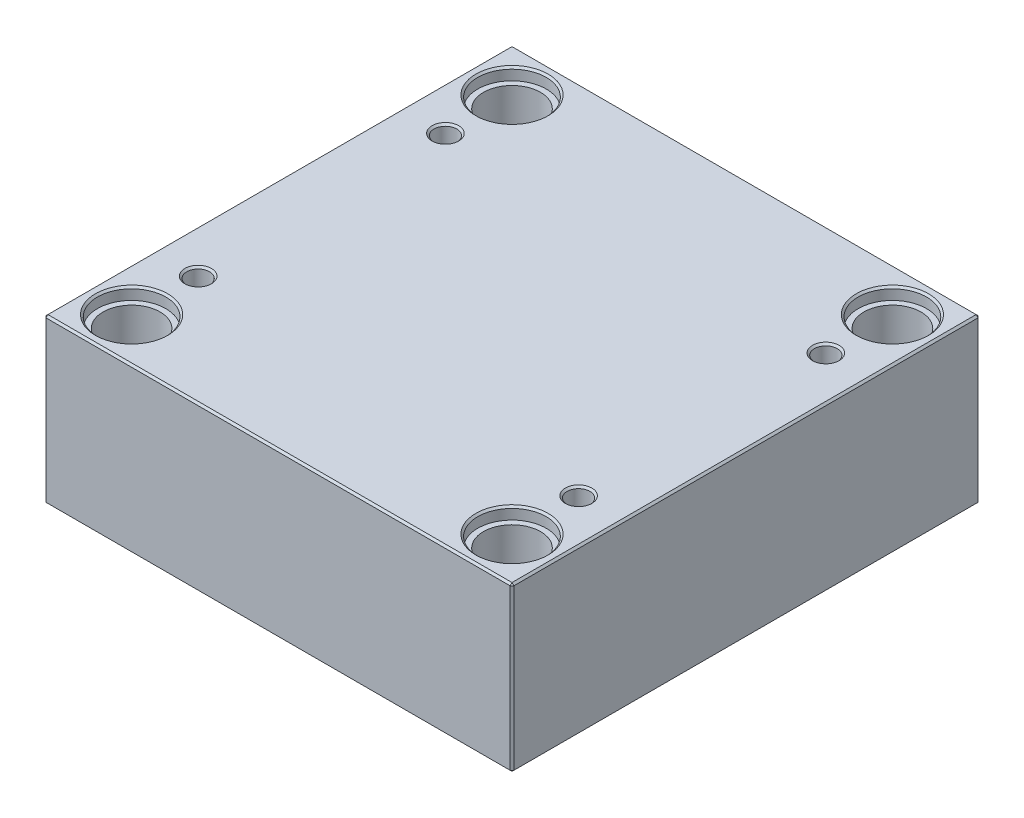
ISO-10303-21;
HEADER;
FILE_DESCRIPTION(('STEP AP214'),'2;1');
FILE_NAME('part.step','',(''),(''),'','','');
FILE_SCHEMA(('AUTOMOTIVE_DESIGN { 1 0 10303 214 1 1 1 1 }'));
ENDSEC;
DATA;
#1=APPLICATION_CONTEXT('core data for automotive mechanical design processes');
#2=APPLICATION_PROTOCOL_DEFINITION('international standard','automotive_design',2000,#1);
#3=PRODUCT_CONTEXT('',#1,'mechanical');
#4=PRODUCT('Part','Part','',(#3));
#5=PRODUCT_RELATED_PRODUCT_CATEGORY('part','',(#4));
#6=PRODUCT_DEFINITION_FORMATION('','',#4);
#7=PRODUCT_DEFINITION_CONTEXT('part definition',#1,'design');
#8=PRODUCT_DEFINITION('design','',#6,#7);
#9=PRODUCT_DEFINITION_SHAPE('','',#8);
#10=(LENGTH_UNIT() NAMED_UNIT(*) SI_UNIT(.MILLI.,.METRE.));
#11=(NAMED_UNIT(*) PLANE_ANGLE_UNIT() SI_UNIT($,.RADIAN.));
#12=(NAMED_UNIT(*) SI_UNIT($,.STERADIAN.) SOLID_ANGLE_UNIT());
#13=UNCERTAINTY_MEASURE_WITH_UNIT(LENGTH_MEASURE(1.E-05),#10,'distance_accuracy_value','');
#14=(GEOMETRIC_REPRESENTATION_CONTEXT(3) GLOBAL_UNCERTAINTY_ASSIGNED_CONTEXT((#13)) GLOBAL_UNIT_ASSIGNED_CONTEXT((#10,
#11,#12)) REPRESENTATION_CONTEXT('',''));
#15=CARTESIAN_POINT('',(0.,0.,0.));
#16=DIRECTION('',(0.,0.,1.));
#17=DIRECTION('',(1.,0.,0.));
#18=AXIS2_PLACEMENT_3D('',#15,#16,#17);
#19=CARTESIAN_POINT('',(-100.,0.,-100.));
#20=DIRECTION('',(0.,1.,0.));
#21=DIRECTION('',(0.,0.,1.));
#22=AXIS2_PLACEMENT_3D('',#19,#20,#21);
#23=CYLINDRICAL_SURFACE('',#22,15.);
#24=CARTESIAN_POINT('',(-100.,1.00000000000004,-100.));
#25=DIRECTION('',(0.,1.,0.));
#26=DIRECTION('',(0.,0.,1.));
#27=AXIS2_PLACEMENT_3D('',#24,#25,#26);
#28=CIRCLE('',#27,15.);
#29=CARTESIAN_POINT('',(-100.,1.00000000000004,-85.));
#30=VERTEX_POINT('',#29);
#31=EDGE_CURVE('E472',#30,#30,#28,.F.);
#32=ORIENTED_EDGE('',*,*,#31,.T.);
#33=EDGE_LOOP('',(#32));
#34=FACE_BOUND('',#33,.T.);
#35=CARTESIAN_POINT('',(-100.,79.7,-100.));
#36=DIRECTION('',(0.,1.,0.));
#37=DIRECTION('',(0.,0.,1.));
#38=AXIS2_PLACEMENT_3D('',#35,#36,#37);
#39=CIRCLE('',#38,15.);
#40=CARTESIAN_POINT('',(-100.,79.7,-85.));
#41=VERTEX_POINT('',#40);
#42=EDGE_CURVE('E221',#41,#41,#39,.F.);
#43=ORIENTED_EDGE('',*,*,#42,.F.);
#44=EDGE_LOOP('',(#43));
#45=FACE_BOUND('',#44,.T.);
#46=ADVANCED_FACE('F16',(#34,#45),#23,.F.);
#47=CARTESIAN_POINT('',(100.,0.,-100.));
#48=DIRECTION('',(0.,1.,0.));
#49=DIRECTION('',(0.,0.,1.));
#50=AXIS2_PLACEMENT_3D('',#47,#48,#49);
#51=CYLINDRICAL_SURFACE('',#50,15.);
#52=CARTESIAN_POINT('',(100.,1.00000000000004,-100.));
#53=DIRECTION('',(0.,1.,0.));
#54=DIRECTION('',(0.,0.,1.));
#55=AXIS2_PLACEMENT_3D('',#52,#53,#54);
#56=CIRCLE('',#55,15.);
#57=CARTESIAN_POINT('',(100.,1.00000000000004,-85.));
#58=VERTEX_POINT('',#57);
#59=EDGE_CURVE('E474',#58,#58,#56,.F.);
#60=ORIENTED_EDGE('',*,*,#59,.T.);
#61=EDGE_LOOP('',(#60));
#62=FACE_BOUND('',#61,.T.);
#63=CARTESIAN_POINT('',(100.,79.7,-100.));
#64=DIRECTION('',(0.,1.,0.));
#65=DIRECTION('',(0.,0.,1.));
#66=AXIS2_PLACEMENT_3D('',#63,#64,#65);
#67=CIRCLE('',#66,15.);
#68=CARTESIAN_POINT('',(100.,79.7,-85.));
#69=VERTEX_POINT('',#68);
#70=EDGE_CURVE('E218',#69,#69,#67,.F.);
#71=ORIENTED_EDGE('',*,*,#70,.F.);
#72=EDGE_LOOP('',(#71));
#73=FACE_BOUND('',#72,.T.);
#74=ADVANCED_FACE('F263',(#62,#73),#51,.F.);
#75=CARTESIAN_POINT('',(100.,0.,100.));
#76=DIRECTION('',(0.,1.,0.));
#77=DIRECTION('',(0.,0.,1.));
#78=AXIS2_PLACEMENT_3D('',#75,#76,#77);
#79=CYLINDRICAL_SURFACE('',#78,15.);
#80=CARTESIAN_POINT('',(100.,1.00000000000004,100.));
#81=DIRECTION('',(0.,1.,0.));
#82=DIRECTION('',(0.,0.,1.));
#83=AXIS2_PLACEMENT_3D('',#80,#81,#82);
#84=CIRCLE('',#83,15.);
#85=CARTESIAN_POINT('',(100.,1.00000000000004,115.));
#86=VERTEX_POINT('',#85);
#87=EDGE_CURVE('E477',#86,#86,#84,.F.);
#88=ORIENTED_EDGE('',*,*,#87,.T.);
#89=EDGE_LOOP('',(#88));
#90=FACE_BOUND('',#89,.T.);
#91=CARTESIAN_POINT('',(100.,79.7,100.));
#92=DIRECTION('',(0.,1.,0.));
#93=DIRECTION('',(0.,0.,1.));
#94=AXIS2_PLACEMENT_3D('',#91,#92,#93);
#95=CIRCLE('',#94,15.);
#96=CARTESIAN_POINT('',(100.,79.7,115.));
#97=VERTEX_POINT('',#96);
#98=EDGE_CURVE('E214',#97,#97,#95,.F.);
#99=ORIENTED_EDGE('',*,*,#98,.F.);
#100=EDGE_LOOP('',(#99));
#101=FACE_BOUND('',#100,.T.);
#102=ADVANCED_FACE('F270',(#90,#101),#79,.F.);
#103=CARTESIAN_POINT('',(-100.,0.,100.));
#104=DIRECTION('',(0.,1.,0.));
#105=DIRECTION('',(0.,0.,1.));
#106=AXIS2_PLACEMENT_3D('',#103,#104,#105);
#107=CYLINDRICAL_SURFACE('',#106,15.);
#108=CARTESIAN_POINT('',(-100.,1.00000000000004,100.));
#109=DIRECTION('',(0.,1.,0.));
#110=DIRECTION('',(0.,0.,1.));
#111=AXIS2_PLACEMENT_3D('',#108,#109,#110);
#112=CIRCLE('',#111,15.);
#113=CARTESIAN_POINT('',(-100.,1.00000000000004,115.));
#114=VERTEX_POINT('',#113);
#115=EDGE_CURVE('E480',#114,#114,#112,.F.);
#116=ORIENTED_EDGE('',*,*,#115,.T.);
#117=EDGE_LOOP('',(#116));
#118=FACE_BOUND('',#117,.T.);
#119=CARTESIAN_POINT('',(-100.,79.7,100.));
#120=DIRECTION('',(0.,1.,0.));
#121=DIRECTION('',(0.,0.,1.));
#122=AXIS2_PLACEMENT_3D('',#119,#120,#121);
#123=CIRCLE('',#122,15.);
#124=CARTESIAN_POINT('',(-100.,79.7,115.));
#125=VERTEX_POINT('',#124);
#126=EDGE_CURVE('E211',#125,#125,#123,.F.);
#127=ORIENTED_EDGE('',*,*,#126,.F.);
#128=EDGE_LOOP('',(#127));
#129=FACE_BOUND('',#128,.T.);
#130=ADVANCED_FACE('F277',(#118,#129),#107,.F.);
#131=CARTESIAN_POINT('',(-123.,86.,123.));
#132=DIRECTION('',(1.,0.,0.));
#133=DIRECTION('',(0.,0.,-1.));
#134=AXIS2_PLACEMENT_3D('',#131,#132,#133);
#135=PLANE('',#134);
#136=DIRECTION('',(0.,-1.,0.));
#137=VECTOR('',#136,1.);
#138=CARTESIAN_POINT('',(-123.,86.,-122.));
#139=LINE('',#138,#137);
#140=CARTESIAN_POINT('',(-123.,85.,-122.));
#141=VERTEX_POINT('',#140);
#142=CARTESIAN_POINT('',(-123.,1.,-122.));
#143=VERTEX_POINT('',#142);
#144=EDGE_CURVE('E487',#141,#143,#139,.T.);
#145=ORIENTED_EDGE('',*,*,#144,.T.);
#146=DIRECTION('',(0.,0.,1.));
#147=VECTOR('',#146,1.);
#148=CARTESIAN_POINT('',(-123.,1.,123.));
#149=LINE('',#148,#147);
#150=CARTESIAN_POINT('',(-123.,1.,122.));
#151=VERTEX_POINT('',#150);
#152=EDGE_CURVE('E490',#143,#151,#149,.T.);
#153=ORIENTED_EDGE('',*,*,#152,.T.);
#154=DIRECTION('',(0.,1.,0.));
#155=VECTOR('',#154,1.);
#156=CARTESIAN_POINT('',(-123.,86.,122.));
#157=LINE('',#156,#155);
#158=CARTESIAN_POINT('',(-123.,85.,122.));
#159=VERTEX_POINT('',#158);
#160=EDGE_CURVE('E485',#151,#159,#157,.T.);
#161=ORIENTED_EDGE('',*,*,#160,.T.);
#162=DIRECTION('',(0.,0.,-1.));
#163=VECTOR('',#162,1.);
#164=CARTESIAN_POINT('',(-123.,85.,-123.));
#165=LINE('',#164,#163);
#166=EDGE_CURVE('E483',#159,#141,#165,.T.);
#167=ORIENTED_EDGE('',*,*,#166,.T.);
#168=EDGE_LOOP('',(#145,#153,#161,#167));
#169=FACE_BOUND('',#168,.T.);
#170=ADVANCED_FACE('F298',(#169),#135,.F.);
#171=CARTESIAN_POINT('',(123.,86.,123.));
#172=DIRECTION('',(0.,0.,-1.));
#173=DIRECTION('',(-1.,0.,0.));
#174=AXIS2_PLACEMENT_3D('',#171,#172,#173);
#175=PLANE('',#174);
#176=DIRECTION('',(-1.,0.,0.));
#177=VECTOR('',#176,1.);
#178=CARTESIAN_POINT('',(-123.,85.,123.));
#179=LINE('',#178,#177);
#180=CARTESIAN_POINT('',(122.,85.,123.));
#181=VERTEX_POINT('',#180);
#182=CARTESIAN_POINT('',(-122.,85.,123.));
#183=VERTEX_POINT('',#182);
#184=EDGE_CURVE('E509',#181,#183,#179,.T.);
#185=ORIENTED_EDGE('',*,*,#184,.T.);
#186=DIRECTION('',(0.,-1.,0.));
#187=VECTOR('',#186,1.);
#188=CARTESIAN_POINT('',(-122.,86.,123.));
#189=LINE('',#188,#187);
#190=CARTESIAN_POINT('',(-122.,0.999999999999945,123.));
#191=VERTEX_POINT('',#190);
#192=EDGE_CURVE('E515',#183,#191,#189,.T.);
#193=ORIENTED_EDGE('',*,*,#192,.T.);
#194=DIRECTION('',(1.,0.,0.));
#195=VECTOR('',#194,1.);
#196=CARTESIAN_POINT('',(123.,0.999999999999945,123.));
#197=LINE('',#196,#195);
#198=CARTESIAN_POINT('',(122.,0.999999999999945,123.));
#199=VERTEX_POINT('',#198);
#200=EDGE_CURVE('E513',#191,#199,#197,.T.);
#201=ORIENTED_EDGE('',*,*,#200,.T.);
#202=DIRECTION('',(0.,1.,0.));
#203=VECTOR('',#202,1.);
#204=CARTESIAN_POINT('',(122.,86.,123.));
#205=LINE('',#204,#203);
#206=EDGE_CURVE('E511',#199,#181,#205,.T.);
#207=ORIENTED_EDGE('',*,*,#206,.T.);
#208=EDGE_LOOP('',(#185,#193,#201,#207));
#209=FACE_BOUND('',#208,.T.);
#210=ADVANCED_FACE('F294',(#209),#175,.F.);
#211=CARTESIAN_POINT('',(123.,86.,123.));
#212=DIRECTION('',(-1.,0.,0.));
#213=DIRECTION('',(0.,0.,1.));
#214=AXIS2_PLACEMENT_3D('',#211,#212,#213);
#215=PLANE('',#214);
#216=DIRECTION('',(0.,0.,-1.));
#217=VECTOR('',#216,1.);
#218=CARTESIAN_POINT('',(123.,0.999999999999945,123.));
#219=LINE('',#218,#217);
#220=CARTESIAN_POINT('',(123.,0.999999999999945,122.));
#221=VERTEX_POINT('',#220);
#222=CARTESIAN_POINT('',(123.,0.999999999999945,-122.));
#223=VERTEX_POINT('',#222);
#224=EDGE_CURVE('E504',#221,#223,#219,.T.);
#225=ORIENTED_EDGE('',*,*,#224,.T.);
#226=DIRECTION('',(0.,1.,0.));
#227=VECTOR('',#226,1.);
#228=CARTESIAN_POINT('',(123.,86.,-122.));
#229=LINE('',#228,#227);
#230=CARTESIAN_POINT('',(123.,85.,-122.));
#231=VERTEX_POINT('',#230);
#232=EDGE_CURVE('E506',#223,#231,#229,.T.);
#233=ORIENTED_EDGE('',*,*,#232,.T.);
#234=DIRECTION('',(0.,0.,1.));
#235=VECTOR('',#234,1.);
#236=CARTESIAN_POINT('',(123.,85.,123.));
#237=LINE('',#236,#235);
#238=CARTESIAN_POINT('',(123.,85.,122.));
#239=VERTEX_POINT('',#238);
#240=EDGE_CURVE('E500',#231,#239,#237,.T.);
#241=ORIENTED_EDGE('',*,*,#240,.T.);
#242=DIRECTION('',(0.,-1.,0.));
#243=VECTOR('',#242,1.);
#244=CARTESIAN_POINT('',(123.,86.,122.));
#245=LINE('',#244,#243);
#246=EDGE_CURVE('E502',#239,#221,#245,.T.);
#247=ORIENTED_EDGE('',*,*,#246,.T.);
#248=EDGE_LOOP('',(#225,#233,#241,#247));
#249=FACE_BOUND('',#248,.T.);
#250=ADVANCED_FACE('F290',(#249),#215,.F.);
#251=CARTESIAN_POINT('',(123.,86.,-123.));
#252=DIRECTION('',(0.,0.,1.));
#253=DIRECTION('',(1.,0.,0.));
#254=AXIS2_PLACEMENT_3D('',#251,#252,#253);
#255=PLANE('',#254);
#256=DIRECTION('',(0.,-1.,0.));
#257=VECTOR('',#256,1.);
#258=CARTESIAN_POINT('',(122.,86.,-123.));
#259=LINE('',#258,#257);
#260=CARTESIAN_POINT('',(122.,85.,-123.));
#261=VERTEX_POINT('',#260);
#262=CARTESIAN_POINT('',(122.,0.999999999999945,-123.));
#263=VERTEX_POINT('',#262);
#264=EDGE_CURVE('E494',#261,#263,#259,.T.);
#265=ORIENTED_EDGE('',*,*,#264,.T.);
#266=DIRECTION('',(-1.,0.,0.));
#267=VECTOR('',#266,1.);
#268=CARTESIAN_POINT('',(123.,0.999999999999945,-123.));
#269=LINE('',#268,#267);
#270=CARTESIAN_POINT('',(-122.,0.999999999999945,-123.));
#271=VERTEX_POINT('',#270);
#272=EDGE_CURVE('E138',#263,#271,#269,.T.);
#273=ORIENTED_EDGE('',*,*,#272,.T.);
#274=DIRECTION('',(0.,1.,0.));
#275=VECTOR('',#274,1.);
#276=CARTESIAN_POINT('',(-122.,86.,-123.));
#277=LINE('',#276,#275);
#278=CARTESIAN_POINT('',(-122.,85.,-123.));
#279=VERTEX_POINT('',#278);
#280=EDGE_CURVE('E496',#271,#279,#277,.T.);
#281=ORIENTED_EDGE('',*,*,#280,.T.);
#282=DIRECTION('',(1.,0.,0.));
#283=VECTOR('',#282,1.);
#284=CARTESIAN_POINT('',(123.,85.,-123.));
#285=LINE('',#284,#283);
#286=EDGE_CURVE('E492',#279,#261,#285,.T.);
#287=ORIENTED_EDGE('',*,*,#286,.T.);
#288=EDGE_LOOP('',(#265,#273,#281,#287));
#289=FACE_BOUND('',#288,.T.);
#290=ADVANCED_FACE('F282',(#289),#255,.F.);
#291=CARTESIAN_POINT('',(0.,86.,0.));
#292=DIRECTION('',(0.,1.,0.));
#293=DIRECTION('',(0.,0.,1.));
#294=AXIS2_PLACEMENT_3D('',#291,#292,#293);
#295=PLANE('',#294);
#296=CARTESIAN_POINT('',(100.,86.,100.));
#297=DIRECTION('',(0.,1.,0.));
#298=DIRECTION('',(0.,0.,1.));
#299=AXIS2_PLACEMENT_3D('',#296,#297,#298);
#300=CIRCLE('',#299,19.);
#301=CARTESIAN_POINT('',(100.,86.,119.));
#302=VERTEX_POINT('',#301);
#303=EDGE_CURVE('E236',#302,#302,#300,.F.);
#304=ORIENTED_EDGE('',*,*,#303,.T.);
#305=EDGE_LOOP('',(#304));
#306=FACE_BOUND('',#305,.T.);
#307=CARTESIAN_POINT('',(-100.,86.,100.));
#308=DIRECTION('',(0.,1.,0.));
#309=DIRECTION('',(0.,0.,1.));
#310=AXIS2_PLACEMENT_3D('',#307,#308,#309);
#311=CIRCLE('',#310,19.);
#312=CARTESIAN_POINT('',(-100.,86.,119.));
#313=VERTEX_POINT('',#312);
#314=EDGE_CURVE('E233',#313,#313,#311,.F.);
#315=ORIENTED_EDGE('',*,*,#314,.T.);
#316=EDGE_LOOP('',(#315));
#317=FACE_BOUND('',#316,.T.);
#318=CARTESIAN_POINT('',(100.,86.,-100.));
#319=DIRECTION('',(0.,1.,0.));
#320=DIRECTION('',(0.,0.,1.));
#321=AXIS2_PLACEMENT_3D('',#318,#319,#320);
#322=CIRCLE('',#321,19.);
#323=CARTESIAN_POINT('',(100.,86.,-81.));
#324=VERTEX_POINT('',#323);
#325=EDGE_CURVE('E230',#324,#324,#322,.F.);
#326=ORIENTED_EDGE('',*,*,#325,.T.);
#327=EDGE_LOOP('',(#326));
#328=FACE_BOUND('',#327,.T.);
#329=CARTESIAN_POINT('',(-100.,86.,-100.));
#330=DIRECTION('',(0.,1.,0.));
#331=DIRECTION('',(0.,0.,1.));
#332=AXIS2_PLACEMENT_3D('',#329,#330,#331);
#333=CIRCLE('',#332,19.);
#334=CARTESIAN_POINT('',(-100.,86.,-81.));
#335=VERTEX_POINT('',#334);
#336=EDGE_CURVE('E227',#335,#335,#333,.F.);
#337=ORIENTED_EDGE('',*,*,#336,.T.);
#338=EDGE_LOOP('',(#337));
#339=FACE_BOUND('',#338,.T.);
#340=CARTESIAN_POINT('',(-100.,86.,65.));
#341=DIRECTION('',(0.,1.,0.));
#342=DIRECTION('',(0.,0.,1.));
#343=AXIS2_PLACEMENT_3D('',#340,#341,#342);
#344=CIRCLE('',#343,7.);
#345=CARTESIAN_POINT('',(-100.,86.,72.));
#346=VERTEX_POINT('',#345);
#347=EDGE_CURVE('E198',#346,#346,#344,.F.);
#348=ORIENTED_EDGE('',*,*,#347,.T.);
#349=EDGE_LOOP('',(#348));
#350=FACE_BOUND('',#349,.T.);
#351=CARTESIAN_POINT('',(100.,86.,65.));
#352=DIRECTION('',(0.,1.,0.));
#353=DIRECTION('',(0.,0.,1.));
#354=AXIS2_PLACEMENT_3D('',#351,#352,#353);
#355=CIRCLE('',#354,7.);
#356=CARTESIAN_POINT('',(100.,86.,72.));
#357=VERTEX_POINT('',#356);
#358=EDGE_CURVE('E195',#357,#357,#355,.F.);
#359=ORIENTED_EDGE('',*,*,#358,.T.);
#360=EDGE_LOOP('',(#359));
#361=FACE_BOUND('',#360,.T.);
#362=CARTESIAN_POINT('',(100.,86.,-65.));
#363=DIRECTION('',(0.,1.,0.));
#364=DIRECTION('',(0.,0.,1.));
#365=AXIS2_PLACEMENT_3D('',#362,#363,#364);
#366=CIRCLE('',#365,7.);
#367=CARTESIAN_POINT('',(100.,86.,-58.));
#368=VERTEX_POINT('',#367);
#369=EDGE_CURVE('E192',#368,#368,#366,.F.);
#370=ORIENTED_EDGE('',*,*,#369,.T.);
#371=EDGE_LOOP('',(#370));
#372=FACE_BOUND('',#371,.T.);
#373=CARTESIAN_POINT('',(-100.,86.,-65.));
#374=DIRECTION('',(0.,1.,0.));
#375=DIRECTION('',(0.,0.,1.));
#376=AXIS2_PLACEMENT_3D('',#373,#374,#375);
#377=CIRCLE('',#376,7.);
#378=CARTESIAN_POINT('',(-100.,86.,-58.));
#379=VERTEX_POINT('',#378);
#380=EDGE_CURVE('E188',#379,#379,#377,.F.);
#381=ORIENTED_EDGE('',*,*,#380,.T.);
#382=EDGE_LOOP('',(#381));
#383=FACE_BOUND('',#382,.T.);
#384=DIRECTION('',(0.,0.,-1.));
#385=VECTOR('',#384,1.);
#386=CARTESIAN_POINT('',(122.,86.,-123.));
#387=LINE('',#386,#385);
#388=CARTESIAN_POINT('',(122.,86.,122.));
#389=VERTEX_POINT('',#388);
#390=CARTESIAN_POINT('',(122.,86.,-122.));
#391=VERTEX_POINT('',#390);
#392=EDGE_CURVE('E31',#389,#391,#387,.T.);
#393=ORIENTED_EDGE('',*,*,#392,.T.);
#394=DIRECTION('',(-1.,0.,0.));
#395=VECTOR('',#394,1.);
#396=CARTESIAN_POINT('',(-123.,86.,-122.));
#397=LINE('',#396,#395);
#398=CARTESIAN_POINT('',(-122.,86.,-122.));
#399=VERTEX_POINT('',#398);
#400=EDGE_CURVE('E189',#391,#399,#397,.T.);
#401=ORIENTED_EDGE('',*,*,#400,.T.);
#402=DIRECTION('',(0.,0.,1.));
#403=VECTOR('',#402,1.);
#404=CARTESIAN_POINT('',(-122.,86.,123.));
#405=LINE('',#404,#403);
#406=CARTESIAN_POINT('',(-122.,86.,122.));
#407=VERTEX_POINT('',#406);
#408=EDGE_CURVE('E518',#399,#407,#405,.T.);
#409=ORIENTED_EDGE('',*,*,#408,.T.);
#410=DIRECTION('',(1.,0.,0.));
#411=VECTOR('',#410,1.);
#412=CARTESIAN_POINT('',(123.,86.,122.));
#413=LINE('',#412,#411);
#414=EDGE_CURVE('E36',#407,#389,#413,.T.);
#415=ORIENTED_EDGE('',*,*,#414,.T.);
#416=EDGE_LOOP('',(#393,#401,#409,#415));
#417=FACE_BOUND('',#416,.T.);
#418=ADVANCED_FACE('F279',(#306,#317,#328,#339,#350,#361,#372,#383,#417),#295,.T.);
#419=CARTESIAN_POINT('',(0.,0.,0.));
#420=DIRECTION('',(0.,1.,0.));
#421=DIRECTION('',(0.,0.,1.));
#422=AXIS2_PLACEMENT_3D('',#419,#420,#421);
#423=PLANE('',#422);
#424=CARTESIAN_POINT('',(-100.,0.,-100.));
#425=DIRECTION('',(0.,1.,0.));
#426=DIRECTION('',(0.,0.,1.));
#427=AXIS2_PLACEMENT_3D('',#424,#425,#426);
#428=CIRCLE('',#427,16.);
#429=CARTESIAN_POINT('',(-100.,0.,-84.));
#430=VERTEX_POINT('',#429);
#431=EDGE_CURVE('E469',#430,#430,#428,.T.);
#432=ORIENTED_EDGE('',*,*,#431,.T.);
#433=EDGE_LOOP('',(#432));
#434=FACE_BOUND('',#433,.T.);
#435=CARTESIAN_POINT('',(100.,0.,-100.));
#436=DIRECTION('',(0.,1.,0.));
#437=DIRECTION('',(0.,0.,1.));
#438=AXIS2_PLACEMENT_3D('',#435,#436,#437);
#439=CIRCLE('',#438,16.);
#440=CARTESIAN_POINT('',(100.,0.,-84.));
#441=VERTEX_POINT('',#440);
#442=EDGE_CURVE('E466',#441,#441,#439,.T.);
#443=ORIENTED_EDGE('',*,*,#442,.T.);
#444=EDGE_LOOP('',(#443));
#445=FACE_BOUND('',#444,.T.);
#446=CARTESIAN_POINT('',(100.,0.,100.));
#447=DIRECTION('',(0.,1.,0.));
#448=DIRECTION('',(0.,0.,1.));
#449=AXIS2_PLACEMENT_3D('',#446,#447,#448);
#450=CIRCLE('',#449,16.);
#451=CARTESIAN_POINT('',(100.,0.,116.));
#452=VERTEX_POINT('',#451);
#453=EDGE_CURVE('E463',#452,#452,#450,.T.);
#454=ORIENTED_EDGE('',*,*,#453,.T.);
#455=EDGE_LOOP('',(#454));
#456=FACE_BOUND('',#455,.T.);
#457=CARTESIAN_POINT('',(-100.,0.,100.));
#458=DIRECTION('',(0.,1.,0.));
#459=DIRECTION('',(0.,0.,1.));
#460=AXIS2_PLACEMENT_3D('',#457,#458,#459);
#461=CIRCLE('',#460,16.);
#462=CARTESIAN_POINT('',(-100.,0.,116.));
#463=VERTEX_POINT('',#462);
#464=EDGE_CURVE('E460',#463,#463,#461,.T.);
#465=ORIENTED_EDGE('',*,*,#464,.T.);
#466=EDGE_LOOP('',(#465));
#467=FACE_BOUND('',#466,.T.);
#468=DIRECTION('',(0.,0.,1.));
#469=VECTOR('',#468,1.);
#470=CARTESIAN_POINT('',(122.,0.,0.));
#471=LINE('',#470,#469);
#472=CARTESIAN_POINT('',(122.,0.,-122.));
#473=VERTEX_POINT('',#472);
#474=CARTESIAN_POINT('',(122.,0.,122.));
#475=VERTEX_POINT('',#474);
#476=EDGE_CURVE('E108',#473,#475,#471,.T.);
#477=ORIENTED_EDGE('',*,*,#476,.T.);
#478=DIRECTION('',(-1.,0.,0.));
#479=VECTOR('',#478,1.);
#480=CARTESIAN_POINT('',(0.,0.,122.));
#481=LINE('',#480,#479);
#482=CARTESIAN_POINT('',(-122.,0.,122.));
#483=VERTEX_POINT('',#482);
#484=EDGE_CURVE('E458',#475,#483,#481,.T.);
#485=ORIENTED_EDGE('',*,*,#484,.T.);
#486=DIRECTION('',(0.,0.,-1.));
#487=VECTOR('',#486,1.);
#488=CARTESIAN_POINT('',(-122.,0.,0.));
#489=LINE('',#488,#487);
#490=CARTESIAN_POINT('',(-122.,0.,-122.));
#491=VERTEX_POINT('',#490);
#492=EDGE_CURVE('E110',#483,#491,#489,.T.);
#493=ORIENTED_EDGE('',*,*,#492,.T.);
#494=DIRECTION('',(1.,0.,0.));
#495=VECTOR('',#494,1.);
#496=CARTESIAN_POINT('',(0.,0.,-122.));
#497=LINE('',#496,#495);
#498=EDGE_CURVE('E104',#491,#473,#497,.T.);
#499=ORIENTED_EDGE('',*,*,#498,.T.);
#500=EDGE_LOOP('',(#477,#485,#493,#499));
#501=FACE_BOUND('',#500,.T.);
#502=ADVANCED_FACE('F106',(#434,#445,#456,#467,#501),#423,.F.);
#503=CARTESIAN_POINT('',(-100.,0.,-100.));
#504=DIRECTION('',(0.,-1.,0.));
#505=DIRECTION('',(0.,0.,-1.));
#506=AXIS2_PLACEMENT_3D('',#503,#504,#505);
#507=CONICAL_SURFACE('',#506,16.,0.785398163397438);
#508=ORIENTED_EDGE('',*,*,#31,.F.);
#509=EDGE_LOOP('',(#508));
#510=FACE_BOUND('',#509,.T.);
#511=ORIENTED_EDGE('',*,*,#431,.F.);
#512=EDGE_LOOP('',(#511));
#513=FACE_BOUND('',#512,.T.);
#514=ADVANCED_FACE('F286',(#510,#513),#507,.F.);
#515=CARTESIAN_POINT('',(100.,0.,-100.));
#516=DIRECTION('',(0.,-1.,0.));
#517=DIRECTION('',(0.,0.,-1.));
#518=AXIS2_PLACEMENT_3D('',#515,#516,#517);
#519=CONICAL_SURFACE('',#518,16.,0.785398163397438);
#520=ORIENTED_EDGE('',*,*,#59,.F.);
#521=EDGE_LOOP('',(#520));
#522=FACE_BOUND('',#521,.T.);
#523=ORIENTED_EDGE('',*,*,#442,.F.);
#524=EDGE_LOOP('',(#523));
#525=FACE_BOUND('',#524,.T.);
#526=ADVANCED_FACE('F305',(#522,#525),#519,.F.);
#527=CARTESIAN_POINT('',(100.,0.,100.));
#528=DIRECTION('',(0.,-1.,0.));
#529=DIRECTION('',(0.,0.,-1.));
#530=AXIS2_PLACEMENT_3D('',#527,#528,#529);
#531=CONICAL_SURFACE('',#530,16.,0.785398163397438);
#532=ORIENTED_EDGE('',*,*,#87,.F.);
#533=EDGE_LOOP('',(#532));
#534=FACE_BOUND('',#533,.T.);
#535=ORIENTED_EDGE('',*,*,#453,.F.);
#536=EDGE_LOOP('',(#535));
#537=FACE_BOUND('',#536,.T.);
#538=ADVANCED_FACE('F309',(#534,#537),#531,.F.);
#539=CARTESIAN_POINT('',(-100.,0.,100.));
#540=DIRECTION('',(0.,-1.,0.));
#541=DIRECTION('',(0.,0.,-1.));
#542=AXIS2_PLACEMENT_3D('',#539,#540,#541);
#543=CONICAL_SURFACE('',#542,16.,0.785398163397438);
#544=ORIENTED_EDGE('',*,*,#115,.F.);
#545=EDGE_LOOP('',(#544));
#546=FACE_BOUND('',#545,.T.);
#547=ORIENTED_EDGE('',*,*,#464,.F.);
#548=EDGE_LOOP('',(#547));
#549=FACE_BOUND('',#548,.T.);
#550=ADVANCED_FACE('F313',(#546,#549),#543,.F.);
#551=CARTESIAN_POINT('',(123.,86.,122.));
#552=DIRECTION('',(-0.707106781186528,0.,-0.707106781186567));
#553=DIRECTION('',(0.,-1.,0.));
#554=AXIS2_PLACEMENT_3D('',#551,#552,#553);
#555=PLANE('',#554);
#556=DIRECTION('',(-0.707106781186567,0.,0.707106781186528));
#557=VECTOR('',#556,1.);
#558=CARTESIAN_POINT('',(122.,85.,123.));
#559=LINE('',#558,#557);
#560=EDGE_CURVE('E126',#181,#239,#559,.F.);
#561=ORIENTED_EDGE('',*,*,#560,.F.);
#562=ORIENTED_EDGE('',*,*,#206,.F.);
#563=DIRECTION('',(0.707106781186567,0.,-0.707106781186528));
#564=VECTOR('',#563,1.);
#565=CARTESIAN_POINT('',(122.,0.999999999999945,123.));
#566=LINE('',#565,#564);
#567=EDGE_CURVE('E180',#221,#199,#566,.F.);
#568=ORIENTED_EDGE('',*,*,#567,.F.);
#569=ORIENTED_EDGE('',*,*,#246,.F.);
#570=EDGE_LOOP('',(#561,#562,#568,#569));
#571=FACE_BOUND('',#570,.T.);
#572=ADVANCED_FACE('F317',(#571),#555,.F.);
#573=CARTESIAN_POINT('',(122.,85.,123.));
#574=DIRECTION('',(0.577350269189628,0.577350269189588,0.577350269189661));
#575=DIRECTION('',(0.707106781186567,0.,-0.707106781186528));
#576=AXIS2_PLACEMENT_3D('',#573,#574,#575);
#577=PLANE('',#576);
#578=DIRECTION('',(0.,-0.70710678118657,0.707106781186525));
#579=VECTOR('',#578,1.);
#580=CARTESIAN_POINT('',(122.,85.,123.));
#581=LINE('',#580,#579);
#582=EDGE_CURVE('E175',#181,#389,#581,.F.);
#583=ORIENTED_EDGE('',*,*,#582,.F.);
#584=ORIENTED_EDGE('',*,*,#560,.T.);
#585=DIRECTION('',(-0.707106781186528,0.707106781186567,0.));
#586=VECTOR('',#585,1.);
#587=CARTESIAN_POINT('',(122.5,85.5,122.));
#588=LINE('',#587,#586);
#589=EDGE_CURVE('E177',#389,#239,#588,.F.);
#590=ORIENTED_EDGE('',*,*,#589,.F.);
#591=EDGE_LOOP('',(#583,#584,#590));
#592=FACE_BOUND('',#591,.T.);
#593=ADVANCED_FACE('F385',(#592),#577,.T.);
#594=CARTESIAN_POINT('',(122.,0.999999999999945,123.));
#595=DIRECTION('',(0.577350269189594,-0.577350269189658,0.577350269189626));
#596=DIRECTION('',(0.,-0.707106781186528,-0.707106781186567));
#597=AXIS2_PLACEMENT_3D('',#594,#595,#596);
#598=PLANE('',#597);
#599=DIRECTION('',(-0.707106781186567,-0.707106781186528,0.));
#600=VECTOR('',#599,1.);
#601=CARTESIAN_POINT('',(122.5,0.499999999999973,122.));
#602=LINE('',#601,#600);
#603=EDGE_CURVE('E124',#221,#475,#602,.T.);
#604=ORIENTED_EDGE('',*,*,#603,.F.);
#605=ORIENTED_EDGE('',*,*,#567,.T.);
#606=DIRECTION('',(0.,0.70710678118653,0.707106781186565));
#607=VECTOR('',#606,1.);
#608=CARTESIAN_POINT('',(122.,0.999999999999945,123.));
#609=LINE('',#608,#607);
#610=EDGE_CURVE('E172',#475,#199,#609,.T.);
#611=ORIENTED_EDGE('',*,*,#610,.F.);
#612=EDGE_LOOP('',(#604,#605,#611));
#613=FACE_BOUND('',#612,.T.);
#614=ADVANCED_FACE('F381',(#613),#598,.T.);
#615=CARTESIAN_POINT('',(122.,86.,0.));
#616=DIRECTION('',(0.707106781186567,0.707106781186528,0.));
#617=DIRECTION('',(0.,0.,1.));
#618=AXIS2_PLACEMENT_3D('',#615,#616,#617);
#619=PLANE('',#618);
#620=ORIENTED_EDGE('',*,*,#589,.T.);
#621=ORIENTED_EDGE('',*,*,#240,.F.);
#622=DIRECTION('',(0.707106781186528,-0.707106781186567,0.));
#623=VECTOR('',#622,1.);
#624=CARTESIAN_POINT('',(123.,85.,-122.));
#625=LINE('',#624,#623);
#626=EDGE_CURVE('E166',#391,#231,#625,.T.);
#627=ORIENTED_EDGE('',*,*,#626,.F.);
#628=ORIENTED_EDGE('',*,*,#392,.F.);
#629=EDGE_LOOP('',(#620,#621,#627,#628));
#630=FACE_BOUND('',#629,.T.);
#631=ADVANCED_FACE('F377',(#630),#619,.T.);
#632=CARTESIAN_POINT('',(0.,86.,122.));
#633=DIRECTION('',(0.,0.707106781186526,0.70710678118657));
#634=DIRECTION('',(-1.,0.,0.));
#635=AXIS2_PLACEMENT_3D('',#632,#633,#634);
#636=PLANE('',#635);
#637=ORIENTED_EDGE('',*,*,#582,.T.);
#638=ORIENTED_EDGE('',*,*,#414,.F.);
#639=DIRECTION('',(0.,0.70710678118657,-0.707106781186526));
#640=VECTOR('',#639,1.);
#641=CARTESIAN_POINT('',(-122.,85.5,122.5));
#642=LINE('',#641,#640);
#643=EDGE_CURVE('E163',#183,#407,#642,.T.);
#644=ORIENTED_EDGE('',*,*,#643,.F.);
#645=ORIENTED_EDGE('',*,*,#184,.F.);
#646=EDGE_LOOP('',(#637,#638,#644,#645));
#647=FACE_BOUND('',#646,.T.);
#648=ADVANCED_FACE('F373',(#647),#636,.T.);
#649=CARTESIAN_POINT('',(-122.,86.,123.));
#650=DIRECTION('',(0.707106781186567,0.,-0.707106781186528));
#651=DIRECTION('',(0.,-1.,0.));
#652=AXIS2_PLACEMENT_3D('',#649,#650,#651);
#653=PLANE('',#652);
#654=DIRECTION('',(0.707106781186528,0.,0.707106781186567));
#655=VECTOR('',#654,1.);
#656=CARTESIAN_POINT('',(-122.,0.999999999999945,123.));
#657=LINE('',#656,#655);
#658=EDGE_CURVE('E157',#191,#151,#657,.F.);
#659=ORIENTED_EDGE('',*,*,#658,.F.);
#660=ORIENTED_EDGE('',*,*,#192,.F.);
#661=DIRECTION('',(-0.707106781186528,0.,-0.707106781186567));
#662=VECTOR('',#661,1.);
#663=CARTESIAN_POINT('',(-123.,85.,122.));
#664=LINE('',#663,#662);
#665=EDGE_CURVE('E160',#159,#183,#664,.F.);
#666=ORIENTED_EDGE('',*,*,#665,.F.);
#667=ORIENTED_EDGE('',*,*,#160,.F.);
#668=EDGE_LOOP('',(#659,#660,#666,#667));
#669=FACE_BOUND('',#668,.T.);
#670=ADVANCED_FACE('F369',(#669),#653,.F.);
#671=CARTESIAN_POINT('',(123.,0.999999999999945,123.));
#672=DIRECTION('',(0.,0.707106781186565,-0.70710678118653));
#673=DIRECTION('',(1.,0.,0.));
#674=AXIS2_PLACEMENT_3D('',#671,#672,#673);
#675=PLANE('',#674);
#676=ORIENTED_EDGE('',*,*,#610,.T.);
#677=ORIENTED_EDGE('',*,*,#200,.F.);
#678=DIRECTION('',(0.,-0.70710678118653,-0.707106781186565));
#679=VECTOR('',#678,1.);
#680=CARTESIAN_POINT('',(-122.,0.999999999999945,123.));
#681=LINE('',#680,#679);
#682=EDGE_CURVE('E135',#483,#191,#681,.F.);
#683=ORIENTED_EDGE('',*,*,#682,.F.);
#684=ORIENTED_EDGE('',*,*,#484,.F.);
#685=EDGE_LOOP('',(#676,#677,#683,#684));
#686=FACE_BOUND('',#685,.T.);
#687=ADVANCED_FACE('F366',(#686),#675,.F.);
#688=CARTESIAN_POINT('',(123.,0.999999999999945,123.));
#689=DIRECTION('',(-0.707106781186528,0.707106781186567,0.));
#690=DIRECTION('',(0.,0.,-1.));
#691=AXIS2_PLACEMENT_3D('',#688,#689,#690);
#692=PLANE('',#691);
#693=ORIENTED_EDGE('',*,*,#603,.T.);
#694=ORIENTED_EDGE('',*,*,#476,.F.);
#695=DIRECTION('',(0.707106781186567,0.707106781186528,0.));
#696=VECTOR('',#695,1.);
#697=CARTESIAN_POINT('',(122.5,0.499999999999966,-122.));
#698=LINE('',#697,#696);
#699=EDGE_CURVE('E121',#223,#473,#698,.F.);
#700=ORIENTED_EDGE('',*,*,#699,.F.);
#701=ORIENTED_EDGE('',*,*,#224,.F.);
#702=EDGE_LOOP('',(#693,#694,#700,#701));
#703=FACE_BOUND('',#702,.T.);
#704=ADVANCED_FACE('F119',(#703),#692,.F.);
#705=CARTESIAN_POINT('',(122.,86.,-123.));
#706=DIRECTION('',(-0.707106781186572,0.,0.707106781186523));
#707=DIRECTION('',(0.,-1.,0.));
#708=AXIS2_PLACEMENT_3D('',#705,#706,#707);
#709=PLANE('',#708);
#710=DIRECTION('',(0.707106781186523,0.,0.707106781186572));
#711=VECTOR('',#710,1.);
#712=CARTESIAN_POINT('',(123.,85.,-122.));
#713=LINE('',#712,#711);
#714=EDGE_CURVE('E168',#231,#261,#713,.F.);
#715=ORIENTED_EDGE('',*,*,#714,.F.);
#716=ORIENTED_EDGE('',*,*,#232,.F.);
#717=DIRECTION('',(-0.707106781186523,0.,-0.707106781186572));
#718=VECTOR('',#717,1.);
#719=CARTESIAN_POINT('',(122.,0.999999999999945,-123.));
#720=LINE('',#719,#718);
#721=EDGE_CURVE('E134',#263,#223,#720,.F.);
#722=ORIENTED_EDGE('',*,*,#721,.F.);
#723=ORIENTED_EDGE('',*,*,#264,.F.);
#724=EDGE_LOOP('',(#715,#716,#722,#723));
#725=FACE_BOUND('',#724,.T.);
#726=ADVANCED_FACE('F359',(#725),#709,.F.);
#727=CARTESIAN_POINT('',(123.,85.,-122.));
#728=DIRECTION('',(0.577350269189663,0.577350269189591,-0.577350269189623));
#729=DIRECTION('',(-0.707106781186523,0.,-0.707106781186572));
#730=AXIS2_PLACEMENT_3D('',#727,#728,#729);
#731=PLANE('',#730);
#732=ORIENTED_EDGE('',*,*,#626,.T.);
#733=ORIENTED_EDGE('',*,*,#714,.T.);
#734=DIRECTION('',(0.,0.707106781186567,0.707106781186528));
#735=VECTOR('',#734,1.);
#736=CARTESIAN_POINT('',(122.,85.5,-122.5));
#737=LINE('',#736,#735);
#738=EDGE_CURVE('E152',#391,#261,#737,.F.);
#739=ORIENTED_EDGE('',*,*,#738,.F.);
#740=EDGE_LOOP('',(#732,#733,#739));
#741=FACE_BOUND('',#740,.T.);
#742=ADVANCED_FACE('F355',(#741),#731,.T.);
#743=CARTESIAN_POINT('',(-123.,85.,122.));
#744=DIRECTION('',(-0.577350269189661,0.577350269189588,0.577350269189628));
#745=DIRECTION('',(0.707106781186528,0.,0.707106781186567));
#746=AXIS2_PLACEMENT_3D('',#743,#744,#745);
#747=PLANE('',#746);
#748=ORIENTED_EDGE('',*,*,#665,.T.);
#749=ORIENTED_EDGE('',*,*,#643,.T.);
#750=DIRECTION('',(-0.707106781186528,-0.707106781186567,0.));
#751=VECTOR('',#750,1.);
#752=CARTESIAN_POINT('',(-123.,85.,122.));
#753=LINE('',#752,#751);
#754=EDGE_CURVE('E143',#159,#407,#753,.F.);
#755=ORIENTED_EDGE('',*,*,#754,.F.);
#756=EDGE_LOOP('',(#748,#749,#755));
#757=FACE_BOUND('',#756,.T.);
#758=ADVANCED_FACE('F351',(#757),#747,.T.);
#759=CARTESIAN_POINT('',(-122.,0.999999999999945,123.));
#760=DIRECTION('',(-0.577350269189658,-0.577350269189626,0.577350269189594));
#761=DIRECTION('',(0.707106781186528,-0.707106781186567,0.));
#762=AXIS2_PLACEMENT_3D('',#759,#760,#761);
#763=PLANE('',#762);
#764=ORIENTED_EDGE('',*,*,#682,.T.);
#765=ORIENTED_EDGE('',*,*,#658,.T.);
#766=DIRECTION('',(-0.707106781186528,0.707106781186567,0.));
#767=VECTOR('',#766,1.);
#768=CARTESIAN_POINT('',(-122.5,0.5,122.));
#769=LINE('',#768,#767);
#770=EDGE_CURVE('E139',#483,#151,#769,.T.);
#771=ORIENTED_EDGE('',*,*,#770,.F.);
#772=EDGE_LOOP('',(#764,#765,#771));
#773=FACE_BOUND('',#772,.T.);
#774=ADVANCED_FACE('F348',(#773),#763,.T.);
#775=CARTESIAN_POINT('',(122.,0.999999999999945,-123.));
#776=DIRECTION('',(0.577350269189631,-0.577350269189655,-0.577350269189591));
#777=DIRECTION('',(0.707106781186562,0.707106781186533,0.));
#778=AXIS2_PLACEMENT_3D('',#775,#776,#777);
#779=PLANE('',#778);
#780=ORIENTED_EDGE('',*,*,#721,.T.);
#781=ORIENTED_EDGE('',*,*,#699,.T.);
#782=DIRECTION('',(0.,-0.707106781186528,0.707106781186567));
#783=VECTOR('',#782,1.);
#784=CARTESIAN_POINT('',(122.,0.999999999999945,-123.));
#785=LINE('',#784,#783);
#786=EDGE_CURVE('E131',#263,#473,#785,.T.);
#787=ORIENTED_EDGE('',*,*,#786,.F.);
#788=EDGE_LOOP('',(#780,#781,#787));
#789=FACE_BOUND('',#788,.T.);
#790=ADVANCED_FACE('F130',(#789),#779,.T.);
#791=CARTESIAN_POINT('',(0.,86.,-122.));
#792=DIRECTION('',(0.,0.707106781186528,-0.707106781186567));
#793=DIRECTION('',(1.,0.,0.));
#794=AXIS2_PLACEMENT_3D('',#791,#792,#793);
#795=PLANE('',#794);
#796=ORIENTED_EDGE('',*,*,#738,.T.);
#797=ORIENTED_EDGE('',*,*,#286,.F.);
#798=DIRECTION('',(0.,-0.707106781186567,-0.707106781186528));
#799=VECTOR('',#798,1.);
#800=CARTESIAN_POINT('',(-122.,85.,-123.));
#801=LINE('',#800,#799);
#802=EDGE_CURVE('E140',#399,#279,#801,.T.);
#803=ORIENTED_EDGE('',*,*,#802,.F.);
#804=ORIENTED_EDGE('',*,*,#400,.F.);
#805=EDGE_LOOP('',(#796,#797,#803,#804));
#806=FACE_BOUND('',#805,.T.);
#807=ADVANCED_FACE('F341',(#806),#795,.T.);
#808=CARTESIAN_POINT('',(-122.,86.,0.));
#809=DIRECTION('',(-0.707106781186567,0.707106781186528,0.));
#810=DIRECTION('',(0.,0.,-1.));
#811=AXIS2_PLACEMENT_3D('',#808,#809,#810);
#812=PLANE('',#811);
#813=ORIENTED_EDGE('',*,*,#754,.T.);
#814=ORIENTED_EDGE('',*,*,#408,.F.);
#815=DIRECTION('',(0.707106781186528,0.707106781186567,0.));
#816=VECTOR('',#815,1.);
#817=CARTESIAN_POINT('',(-122.5,85.5,-122.));
#818=LINE('',#817,#816);
#819=EDGE_CURVE('E146',#141,#399,#818,.T.);
#820=ORIENTED_EDGE('',*,*,#819,.F.);
#821=ORIENTED_EDGE('',*,*,#166,.F.);
#822=EDGE_LOOP('',(#813,#814,#820,#821));
#823=FACE_BOUND('',#822,.T.);
#824=ADVANCED_FACE('F337',(#823),#812,.T.);
#825=CARTESIAN_POINT('',(-123.,1.,123.));
#826=DIRECTION('',(0.707106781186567,0.707106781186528,0.));
#827=DIRECTION('',(0.,0.,1.));
#828=AXIS2_PLACEMENT_3D('',#825,#826,#827);
#829=PLANE('',#828);
#830=ORIENTED_EDGE('',*,*,#770,.T.);
#831=ORIENTED_EDGE('',*,*,#152,.F.);
#832=DIRECTION('',(0.707106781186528,-0.707106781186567,0.));
#833=VECTOR('',#832,1.);
#834=CARTESIAN_POINT('',(-123.,1.,-122.));
#835=LINE('',#834,#833);
#836=EDGE_CURVE('E529',#491,#143,#835,.F.);
#837=ORIENTED_EDGE('',*,*,#836,.F.);
#838=ORIENTED_EDGE('',*,*,#492,.F.);
#839=EDGE_LOOP('',(#830,#831,#837,#838));
#840=FACE_BOUND('',#839,.T.);
#841=ADVANCED_FACE('F334',(#840),#829,.F.);
#842=CARTESIAN_POINT('',(123.,0.999999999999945,-123.));
#843=DIRECTION('',(0.,0.707106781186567,0.707106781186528));
#844=DIRECTION('',(-1.,0.,0.));
#845=AXIS2_PLACEMENT_3D('',#842,#843,#844);
#846=PLANE('',#845);
#847=ORIENTED_EDGE('',*,*,#786,.T.);
#848=ORIENTED_EDGE('',*,*,#498,.F.);
#849=DIRECTION('',(0.,0.707106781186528,-0.707106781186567));
#850=VECTOR('',#849,1.);
#851=CARTESIAN_POINT('',(-122.,0.499999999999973,-122.5));
#852=LINE('',#851,#850);
#853=EDGE_CURVE('E526',#271,#491,#852,.F.);
#854=ORIENTED_EDGE('',*,*,#853,.F.);
#855=ORIENTED_EDGE('',*,*,#272,.F.);
#856=EDGE_LOOP('',(#847,#848,#854,#855));
#857=FACE_BOUND('',#856,.T.);
#858=ADVANCED_FACE('F137',(#857),#846,.F.);
#859=CARTESIAN_POINT('',(-122.,85.,-123.));
#860=DIRECTION('',(-0.577350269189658,0.577350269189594,-0.577350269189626));
#861=DIRECTION('',(-0.707106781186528,0.,0.707106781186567));
#862=AXIS2_PLACEMENT_3D('',#859,#860,#861);
#863=PLANE('',#862);
#864=ORIENTED_EDGE('',*,*,#819,.T.);
#865=ORIENTED_EDGE('',*,*,#802,.T.);
#866=DIRECTION('',(0.707106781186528,0.,-0.707106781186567));
#867=VECTOR('',#866,1.);
#868=CARTESIAN_POINT('',(-122.,85.,-123.));
#869=LINE('',#868,#867);
#870=EDGE_CURVE('E524',#141,#279,#869,.T.);
#871=ORIENTED_EDGE('',*,*,#870,.F.);
#872=EDGE_LOOP('',(#864,#865,#871));
#873=FACE_BOUND('',#872,.T.);
#874=ADVANCED_FACE('F327',(#873),#863,.T.);
#875=CARTESIAN_POINT('',(-123.,1.,-122.));
#876=DIRECTION('',(-0.577350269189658,-0.577350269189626,-0.577350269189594));
#877=DIRECTION('',(0.707106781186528,-0.707106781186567,0.));
#878=AXIS2_PLACEMENT_3D('',#875,#876,#877);
#879=PLANE('',#878);
#880=ORIENTED_EDGE('',*,*,#853,.T.);
#881=ORIENTED_EDGE('',*,*,#836,.T.);
#882=DIRECTION('',(-0.707106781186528,0.,0.707106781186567));
#883=VECTOR('',#882,1.);
#884=CARTESIAN_POINT('',(-123.,1.,-122.));
#885=LINE('',#884,#883);
#886=EDGE_CURVE('E455',#271,#143,#885,.T.);
#887=ORIENTED_EDGE('',*,*,#886,.F.);
#888=EDGE_LOOP('',(#880,#881,#887));
#889=FACE_BOUND('',#888,.T.);
#890=ADVANCED_FACE('F323',(#889),#879,.T.);
#891=CARTESIAN_POINT('',(-123.,86.,-122.));
#892=DIRECTION('',(0.707106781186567,0.,0.707106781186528));
#893=DIRECTION('',(0.,-1.,0.));
#894=AXIS2_PLACEMENT_3D('',#891,#892,#893);
#895=PLANE('',#894);
#896=ORIENTED_EDGE('',*,*,#870,.T.);
#897=ORIENTED_EDGE('',*,*,#280,.F.);
#898=ORIENTED_EDGE('',*,*,#886,.T.);
#899=ORIENTED_EDGE('',*,*,#144,.F.);
#900=EDGE_LOOP('',(#896,#897,#898,#899));
#901=FACE_BOUND('',#900,.T.);
#902=ADVANCED_FACE('F319',(#901),#895,.F.);
#903=CARTESIAN_POINT('',(-100.,62.,-65.));
#904=DIRECTION('',(0.,1.,0.));
#905=DIRECTION('',(0.,0.,1.));
#906=AXIS2_PLACEMENT_3D('',#903,#904,#905);
#907=CYLINDRICAL_SURFACE('',#906,6.);
#908=CARTESIAN_POINT('',(-100.,85.,-65.));
#909=DIRECTION('',(0.,1.,0.));
#910=DIRECTION('',(0.,0.,1.));
#911=AXIS2_PLACEMENT_3D('',#908,#909,#910);
#912=CIRCLE('',#911,6.);
#913=CARTESIAN_POINT('',(-100.,85.,-59.));
#914=VERTEX_POINT('',#913);
#915=EDGE_CURVE('E207',#914,#914,#912,.T.);
#916=ORIENTED_EDGE('',*,*,#915,.T.);
#917=EDGE_LOOP('',(#916));
#918=FACE_BOUND('',#917,.T.);
#919=CARTESIAN_POINT('',(-100.,62.,-65.));
#920=DIRECTION('',(0.,1.,0.));
#921=DIRECTION('',(0.,0.,1.));
#922=AXIS2_PLACEMENT_3D('',#919,#920,#921);
#923=CIRCLE('',#922,6.);
#924=CARTESIAN_POINT('',(-100.,62.,-59.));
#925=VERTEX_POINT('',#924);
#926=EDGE_CURVE('E448',#925,#925,#923,.T.);
#927=ORIENTED_EDGE('',*,*,#926,.F.);
#928=EDGE_LOOP('',(#927));
#929=FACE_BOUND('',#928,.T.);
#930=ADVANCED_FACE('F322',(#918,#929),#907,.F.);
#931=CARTESIAN_POINT('',(-100.,62.,-65.));
#932=DIRECTION('',(0.,1.,0.));
#933=DIRECTION('',(0.,0.,1.));
#934=AXIS2_PLACEMENT_3D('',#931,#932,#933);
#935=PLANE('',#934);
#936=ORIENTED_EDGE('',*,*,#926,.T.);
#937=EDGE_LOOP('',(#936));
#938=FACE_BOUND('',#937,.T.);
#939=ADVANCED_FACE('F596',(#938),#935,.T.);
#940=CARTESIAN_POINT('',(100.,62.,-65.));
#941=DIRECTION('',(0.,1.,0.));
#942=DIRECTION('',(0.,0.,1.));
#943=AXIS2_PLACEMENT_3D('',#940,#941,#942);
#944=CYLINDRICAL_SURFACE('',#943,6.);
#945=CARTESIAN_POINT('',(100.,85.,-65.));
#946=DIRECTION('',(0.,1.,0.));
#947=DIRECTION('',(0.,0.,1.));
#948=AXIS2_PLACEMENT_3D('',#945,#946,#947);
#949=CIRCLE('',#948,6.);
#950=CARTESIAN_POINT('',(100.,85.,-59.));
#951=VERTEX_POINT('',#950);
#952=EDGE_CURVE('E204',#951,#951,#949,.T.);
#953=ORIENTED_EDGE('',*,*,#952,.T.);
#954=EDGE_LOOP('',(#953));
#955=FACE_BOUND('',#954,.T.);
#956=CARTESIAN_POINT('',(100.,62.,-65.));
#957=DIRECTION('',(0.,1.,0.));
#958=DIRECTION('',(0.,0.,1.));
#959=AXIS2_PLACEMENT_3D('',#956,#957,#958);
#960=CIRCLE('',#959,6.);
#961=CARTESIAN_POINT('',(100.,62.,-59.));
#962=VERTEX_POINT('',#961);
#963=EDGE_CURVE('E445',#962,#962,#960,.T.);
#964=ORIENTED_EDGE('',*,*,#963,.F.);
#965=EDGE_LOOP('',(#964));
#966=FACE_BOUND('',#965,.T.);
#967=ADVANCED_FACE('F592',(#955,#966),#944,.F.);
#968=CARTESIAN_POINT('',(100.,62.,-65.));
#969=DIRECTION('',(0.,1.,0.));
#970=DIRECTION('',(0.,0.,1.));
#971=AXIS2_PLACEMENT_3D('',#968,#969,#970);
#972=PLANE('',#971);
#973=ORIENTED_EDGE('',*,*,#963,.T.);
#974=EDGE_LOOP('',(#973));
#975=FACE_BOUND('',#974,.T.);
#976=ADVANCED_FACE('F588',(#975),#972,.T.);
#977=CARTESIAN_POINT('',(100.,62.,65.));
#978=DIRECTION('',(0.,1.,0.));
#979=DIRECTION('',(0.,0.,1.));
#980=AXIS2_PLACEMENT_3D('',#977,#978,#979);
#981=CYLINDRICAL_SURFACE('',#980,6.);
#982=CARTESIAN_POINT('',(100.,85.,65.));
#983=DIRECTION('',(0.,1.,0.));
#984=DIRECTION('',(0.,0.,1.));
#985=AXIS2_PLACEMENT_3D('',#982,#983,#984);
#986=CIRCLE('',#985,6.);
#987=CARTESIAN_POINT('',(100.,85.,71.));
#988=VERTEX_POINT('',#987);
#989=EDGE_CURVE('E201',#988,#988,#986,.T.);
#990=ORIENTED_EDGE('',*,*,#989,.T.);
#991=EDGE_LOOP('',(#990));
#992=FACE_BOUND('',#991,.T.);
#993=CARTESIAN_POINT('',(100.,62.,65.));
#994=DIRECTION('',(0.,1.,0.));
#995=DIRECTION('',(0.,0.,1.));
#996=AXIS2_PLACEMENT_3D('',#993,#994,#995);
#997=CIRCLE('',#996,6.);
#998=CARTESIAN_POINT('',(100.,62.,71.));
#999=VERTEX_POINT('',#998);
#1000=EDGE_CURVE('E449',#999,#999,#997,.T.);
#1001=ORIENTED_EDGE('',*,*,#1000,.F.);
#1002=EDGE_LOOP('',(#1001));
#1003=FACE_BOUND('',#1002,.T.);
#1004=ADVANCED_FACE('F591',(#992,#1003),#981,.F.);
#1005=CARTESIAN_POINT('',(100.,62.,65.));
#1006=DIRECTION('',(0.,1.,0.));
#1007=DIRECTION('',(0.,0.,1.));
#1008=AXIS2_PLACEMENT_3D('',#1005,#1006,#1007);
#1009=PLANE('',#1008);
#1010=ORIENTED_EDGE('',*,*,#1000,.T.);
#1011=EDGE_LOOP('',(#1010));
#1012=FACE_BOUND('',#1011,.T.);
#1013=ADVANCED_FACE('F598',(#1012),#1009,.T.);
#1014=CARTESIAN_POINT('',(-100.,62.,65.));
#1015=DIRECTION('',(0.,1.,0.));
#1016=DIRECTION('',(0.,0.,1.));
#1017=AXIS2_PLACEMENT_3D('',#1014,#1015,#1016);
#1018=CYLINDRICAL_SURFACE('',#1017,6.);
#1019=CARTESIAN_POINT('',(-100.,85.,65.));
#1020=DIRECTION('',(0.,1.,0.));
#1021=DIRECTION('',(0.,0.,1.));
#1022=AXIS2_PLACEMENT_3D('',#1019,#1020,#1021);
#1023=CIRCLE('',#1022,6.);
#1024=CARTESIAN_POINT('',(-100.,85.,71.));
#1025=VERTEX_POINT('',#1024);
#1026=EDGE_CURVE('E185',#1025,#1025,#1023,.T.);
#1027=ORIENTED_EDGE('',*,*,#1026,.T.);
#1028=EDGE_LOOP('',(#1027));
#1029=FACE_BOUND('',#1028,.T.);
#1030=CARTESIAN_POINT('',(-100.,62.,65.));
#1031=DIRECTION('',(0.,1.,0.));
#1032=DIRECTION('',(0.,0.,1.));
#1033=AXIS2_PLACEMENT_3D('',#1030,#1031,#1032);
#1034=CIRCLE('',#1033,6.);
#1035=CARTESIAN_POINT('',(-100.,62.,71.));
#1036=VERTEX_POINT('',#1035);
#1037=EDGE_CURVE('E224',#1036,#1036,#1034,.T.);
#1038=ORIENTED_EDGE('',*,*,#1037,.F.);
#1039=EDGE_LOOP('',(#1038));
#1040=FACE_BOUND('',#1039,.T.);
#1041=ADVANCED_FACE('F601',(#1029,#1040),#1018,.F.);
#1042=CARTESIAN_POINT('',(-100.,62.,65.));
#1043=DIRECTION('',(0.,1.,0.));
#1044=DIRECTION('',(0.,0.,1.));
#1045=AXIS2_PLACEMENT_3D('',#1042,#1043,#1044);
#1046=PLANE('',#1045);
#1047=ORIENTED_EDGE('',*,*,#1037,.T.);
#1048=EDGE_LOOP('',(#1047));
#1049=FACE_BOUND('',#1048,.T.);
#1050=ADVANCED_FACE('F397',(#1049),#1046,.T.);
#1051=CARTESIAN_POINT('',(-100.,85.,65.));
#1052=DIRECTION('',(0.,1.,0.));
#1053=DIRECTION('',(0.,0.,1.));
#1054=AXIS2_PLACEMENT_3D('',#1051,#1052,#1053);
#1055=CONICAL_SURFACE('',#1054,6.,0.785398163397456);
#1056=ORIENTED_EDGE('',*,*,#347,.F.);
#1057=EDGE_LOOP('',(#1056));
#1058=FACE_BOUND('',#1057,.T.);
#1059=ORIENTED_EDGE('',*,*,#1026,.F.);
#1060=EDGE_LOOP('',(#1059));
#1061=FACE_BOUND('',#1060,.T.);
#1062=ADVANCED_FACE('F393',(#1058,#1061),#1055,.F.);
#1063=CARTESIAN_POINT('',(100.,85.,65.));
#1064=DIRECTION('',(0.,1.,0.));
#1065=DIRECTION('',(0.,0.,1.));
#1066=AXIS2_PLACEMENT_3D('',#1063,#1064,#1065);
#1067=CONICAL_SURFACE('',#1066,6.,0.785398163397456);
#1068=ORIENTED_EDGE('',*,*,#358,.F.);
#1069=EDGE_LOOP('',(#1068));
#1070=FACE_BOUND('',#1069,.T.);
#1071=ORIENTED_EDGE('',*,*,#989,.F.);
#1072=EDGE_LOOP('',(#1071));
#1073=FACE_BOUND('',#1072,.T.);
#1074=ADVANCED_FACE('F396',(#1070,#1073),#1067,.F.);
#1075=CARTESIAN_POINT('',(100.,85.,-65.));
#1076=DIRECTION('',(0.,1.,0.));
#1077=DIRECTION('',(0.,0.,1.));
#1078=AXIS2_PLACEMENT_3D('',#1075,#1076,#1077);
#1079=CONICAL_SURFACE('',#1078,6.,0.785398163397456);
#1080=ORIENTED_EDGE('',*,*,#369,.F.);
#1081=EDGE_LOOP('',(#1080));
#1082=FACE_BOUND('',#1081,.T.);
#1083=ORIENTED_EDGE('',*,*,#952,.F.);
#1084=EDGE_LOOP('',(#1083));
#1085=FACE_BOUND('',#1084,.T.);
#1086=ADVANCED_FACE('F401',(#1082,#1085),#1079,.F.);
#1087=CARTESIAN_POINT('',(-100.,85.,-65.));
#1088=DIRECTION('',(0.,1.,0.));
#1089=DIRECTION('',(0.,0.,1.));
#1090=AXIS2_PLACEMENT_3D('',#1087,#1088,#1089);
#1091=CONICAL_SURFACE('',#1090,6.,0.785398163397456);
#1092=ORIENTED_EDGE('',*,*,#380,.F.);
#1093=EDGE_LOOP('',(#1092));
#1094=FACE_BOUND('',#1093,.T.);
#1095=ORIENTED_EDGE('',*,*,#915,.F.);
#1096=EDGE_LOOP('',(#1095));
#1097=FACE_BOUND('',#1096,.T.);
#1098=ADVANCED_FACE('F405',(#1094,#1097),#1091,.F.);
#1099=CARTESIAN_POINT('',(-100.,79.7,100.));
#1100=DIRECTION('',(0.,1.,0.));
#1101=DIRECTION('',(0.,0.,1.));
#1102=AXIS2_PLACEMENT_3D('',#1099,#1100,#1101);
#1103=PLANE('',#1102);
#1104=CARTESIAN_POINT('',(-100.,79.7,100.));
#1105=DIRECTION('',(0.,1.,0.));
#1106=DIRECTION('',(0.,0.,1.));
#1107=AXIS2_PLACEMENT_3D('',#1104,#1105,#1106);
#1108=CIRCLE('',#1107,18.);
#1109=CARTESIAN_POINT('',(-100.,79.7,118.));
#1110=VERTEX_POINT('',#1109);
#1111=EDGE_CURVE('E436',#1110,#1110,#1108,.T.);
#1112=ORIENTED_EDGE('',*,*,#1111,.T.);
#1113=EDGE_LOOP('',(#1112));
#1114=FACE_BOUND('',#1113,.T.);
#1115=ORIENTED_EDGE('',*,*,#126,.T.);
#1116=EDGE_LOOP('',(#1115));
#1117=FACE_BOUND('',#1116,.T.);
#1118=ADVANCED_FACE('F409',(#1114,#1117),#1103,.T.);
#1119=CARTESIAN_POINT('',(-100.,79.7,100.));
#1120=DIRECTION('',(0.,1.,0.));
#1121=DIRECTION('',(0.,0.,1.));
#1122=AXIS2_PLACEMENT_3D('',#1119,#1120,#1121);
#1123=CYLINDRICAL_SURFACE('',#1122,18.);
#1124=CARTESIAN_POINT('',(-100.,85.,100.));
#1125=DIRECTION('',(0.,1.,0.));
#1126=DIRECTION('',(0.,0.,1.));
#1127=AXIS2_PLACEMENT_3D('',#1124,#1125,#1126);
#1128=CIRCLE('',#1127,18.);
#1129=CARTESIAN_POINT('',(-100.,85.,118.));
#1130=VERTEX_POINT('',#1129);
#1131=EDGE_CURVE('E239',#1130,#1130,#1128,.T.);
#1132=ORIENTED_EDGE('',*,*,#1131,.T.);
#1133=EDGE_LOOP('',(#1132));
#1134=FACE_BOUND('',#1133,.T.);
#1135=ORIENTED_EDGE('',*,*,#1111,.F.);
#1136=EDGE_LOOP('',(#1135));
#1137=FACE_BOUND('',#1136,.T.);
#1138=ADVANCED_FACE('F574',(#1134,#1137),#1123,.F.);
#1139=CARTESIAN_POINT('',(100.,79.7,100.));
#1140=DIRECTION('',(0.,1.,0.));
#1141=DIRECTION('',(0.,0.,1.));
#1142=AXIS2_PLACEMENT_3D('',#1139,#1140,#1141);
#1143=PLANE('',#1142);
#1144=CARTESIAN_POINT('',(100.,79.7,100.));
#1145=DIRECTION('',(0.,1.,0.));
#1146=DIRECTION('',(0.,0.,1.));
#1147=AXIS2_PLACEMENT_3D('',#1144,#1145,#1146);
#1148=CIRCLE('',#1147,18.);
#1149=CARTESIAN_POINT('',(100.,79.7,118.));
#1150=VERTEX_POINT('',#1149);
#1151=EDGE_CURVE('E433',#1150,#1150,#1148,.T.);
#1152=ORIENTED_EDGE('',*,*,#1151,.T.);
#1153=EDGE_LOOP('',(#1152));
#1154=FACE_BOUND('',#1153,.T.);
#1155=ORIENTED_EDGE('',*,*,#98,.T.);
#1156=EDGE_LOOP('',(#1155));
#1157=FACE_BOUND('',#1156,.T.);
#1158=ADVANCED_FACE('F429',(#1154,#1157),#1143,.T.);
#1159=CARTESIAN_POINT('',(100.,79.7,100.));
#1160=DIRECTION('',(0.,1.,0.));
#1161=DIRECTION('',(0.,0.,1.));
#1162=AXIS2_PLACEMENT_3D('',#1159,#1160,#1161);
#1163=CYLINDRICAL_SURFACE('',#1162,18.);
#1164=CARTESIAN_POINT('',(100.,85.,100.));
#1165=DIRECTION('',(0.,1.,0.));
#1166=DIRECTION('',(0.,0.,1.));
#1167=AXIS2_PLACEMENT_3D('',#1164,#1165,#1166);
#1168=CIRCLE('',#1167,18.);
#1169=CARTESIAN_POINT('',(100.,85.,118.));
#1170=VERTEX_POINT('',#1169);
#1171=EDGE_CURVE('E210',#1170,#1170,#1168,.T.);
#1172=ORIENTED_EDGE('',*,*,#1171,.T.);
#1173=EDGE_LOOP('',(#1172));
#1174=FACE_BOUND('',#1173,.T.);
#1175=ORIENTED_EDGE('',*,*,#1151,.F.);
#1176=EDGE_LOOP('',(#1175));
#1177=FACE_BOUND('',#1176,.T.);
#1178=ADVANCED_FACE('F425',(#1174,#1177),#1163,.F.);
#1179=CARTESIAN_POINT('',(100.,79.7,-100.));
#1180=DIRECTION('',(0.,1.,0.));
#1181=DIRECTION('',(0.,0.,1.));
#1182=AXIS2_PLACEMENT_3D('',#1179,#1180,#1181);
#1183=PLANE('',#1182);
#1184=CARTESIAN_POINT('',(100.,79.7,-100.));
#1185=DIRECTION('',(0.,1.,0.));
#1186=DIRECTION('',(0.,0.,1.));
#1187=AXIS2_PLACEMENT_3D('',#1184,#1185,#1186);
#1188=CIRCLE('',#1187,18.);
#1189=CARTESIAN_POINT('',(100.,79.7,-82.));
#1190=VERTEX_POINT('',#1189);
#1191=EDGE_CURVE('E435',#1190,#1190,#1188,.T.);
#1192=ORIENTED_EDGE('',*,*,#1191,.T.);
#1193=EDGE_LOOP('',(#1192));
#1194=FACE_BOUND('',#1193,.T.);
#1195=ORIENTED_EDGE('',*,*,#70,.T.);
#1196=EDGE_LOOP('',(#1195));
#1197=FACE_BOUND('',#1196,.T.);
#1198=ADVANCED_FACE('F428',(#1194,#1197),#1183,.T.);
#1199=CARTESIAN_POINT('',(100.,79.7,-100.));
#1200=DIRECTION('',(0.,1.,0.));
#1201=DIRECTION('',(0.,0.,1.));
#1202=AXIS2_PLACEMENT_3D('',#1199,#1200,#1201);
#1203=CYLINDRICAL_SURFACE('',#1202,18.);
#1204=CARTESIAN_POINT('',(100.,85.,-100.));
#1205=DIRECTION('',(0.,1.,0.));
#1206=DIRECTION('',(0.,0.,1.));
#1207=AXIS2_PLACEMENT_3D('',#1204,#1205,#1206);
#1208=CIRCLE('',#1207,18.);
#1209=CARTESIAN_POINT('',(100.,85.,-82.));
#1210=VERTEX_POINT('',#1209);
#1211=EDGE_CURVE('E24',#1210,#1210,#1208,.T.);
#1212=ORIENTED_EDGE('',*,*,#1211,.T.);
#1213=EDGE_LOOP('',(#1212));
#1214=FACE_BOUND('',#1213,.T.);
#1215=ORIENTED_EDGE('',*,*,#1191,.F.);
#1216=EDGE_LOOP('',(#1215));
#1217=FACE_BOUND('',#1216,.T.);
#1218=ADVANCED_FACE('F244',(#1214,#1217),#1203,.F.);
#1219=CARTESIAN_POINT('',(-100.,79.7,-100.));
#1220=DIRECTION('',(0.,1.,0.));
#1221=DIRECTION('',(0.,0.,1.));
#1222=AXIS2_PLACEMENT_3D('',#1219,#1220,#1221);
#1223=PLANE('',#1222);
#1224=CARTESIAN_POINT('',(-100.,79.7,-100.));
#1225=DIRECTION('',(0.,1.,0.));
#1226=DIRECTION('',(0.,0.,1.));
#1227=AXIS2_PLACEMENT_3D('',#1224,#1225,#1226);
#1228=CIRCLE('',#1227,18.);
#1229=CARTESIAN_POINT('',(-100.,79.7,-82.));
#1230=VERTEX_POINT('',#1229);
#1231=EDGE_CURVE('E215',#1230,#1230,#1228,.T.);
#1232=ORIENTED_EDGE('',*,*,#1231,.T.);
#1233=EDGE_LOOP('',(#1232));
#1234=FACE_BOUND('',#1233,.T.);
#1235=ORIENTED_EDGE('',*,*,#42,.T.);
#1236=EDGE_LOOP('',(#1235));
#1237=FACE_BOUND('',#1236,.T.);
#1238=ADVANCED_FACE('F418',(#1234,#1237),#1223,.T.);
#1239=CARTESIAN_POINT('',(-100.,79.7,-100.));
#1240=DIRECTION('',(0.,1.,0.));
#1241=DIRECTION('',(0.,0.,1.));
#1242=AXIS2_PLACEMENT_3D('',#1239,#1240,#1241);
#1243=CYLINDRICAL_SURFACE('',#1242,18.);
#1244=CARTESIAN_POINT('',(-100.,85.,-100.));
#1245=DIRECTION('',(0.,1.,0.));
#1246=DIRECTION('',(0.,0.,1.));
#1247=AXIS2_PLACEMENT_3D('',#1244,#1245,#1246);
#1248=CIRCLE('',#1247,18.);
#1249=CARTESIAN_POINT('',(-100.,85.,-82.));
#1250=VERTEX_POINT('',#1249);
#1251=EDGE_CURVE('E10',#1250,#1250,#1248,.T.);
#1252=ORIENTED_EDGE('',*,*,#1251,.T.);
#1253=EDGE_LOOP('',(#1252));
#1254=FACE_BOUND('',#1253,.T.);
#1255=ORIENTED_EDGE('',*,*,#1231,.F.);
#1256=EDGE_LOOP('',(#1255));
#1257=FACE_BOUND('',#1256,.T.);
#1258=ADVANCED_FACE('F412',(#1254,#1257),#1243,.F.);
#1259=CARTESIAN_POINT('',(100.,85.,100.));
#1260=DIRECTION('',(0.,1.,0.));
#1261=DIRECTION('',(0.,0.,1.));
#1262=AXIS2_PLACEMENT_3D('',#1259,#1260,#1261);
#1263=CONICAL_SURFACE('',#1262,18.,0.785398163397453);
#1264=ORIENTED_EDGE('',*,*,#303,.F.);
#1265=EDGE_LOOP('',(#1264));
#1266=FACE_BOUND('',#1265,.T.);
#1267=ORIENTED_EDGE('',*,*,#1171,.F.);
#1268=EDGE_LOOP('',(#1267));
#1269=FACE_BOUND('',#1268,.T.);
#1270=ADVANCED_FACE('F258',(#1266,#1269),#1263,.F.);
#1271=CARTESIAN_POINT('',(-100.,85.,100.));
#1272=DIRECTION('',(0.,1.,0.));
#1273=DIRECTION('',(0.,0.,1.));
#1274=AXIS2_PLACEMENT_3D('',#1271,#1272,#1273);
#1275=CONICAL_SURFACE('',#1274,18.,0.785398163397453);
#1276=ORIENTED_EDGE('',*,*,#314,.F.);
#1277=EDGE_LOOP('',(#1276));
#1278=FACE_BOUND('',#1277,.T.);
#1279=ORIENTED_EDGE('',*,*,#1131,.F.);
#1280=EDGE_LOOP('',(#1279));
#1281=FACE_BOUND('',#1280,.T.);
#1282=ADVANCED_FACE('F249',(#1278,#1281),#1275,.F.);
#1283=CARTESIAN_POINT('',(100.,85.,-100.));
#1284=DIRECTION('',(0.,1.,0.));
#1285=DIRECTION('',(0.,0.,1.));
#1286=AXIS2_PLACEMENT_3D('',#1283,#1284,#1285);
#1287=CONICAL_SURFACE('',#1286,18.,0.785398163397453);
#1288=ORIENTED_EDGE('',*,*,#325,.F.);
#1289=EDGE_LOOP('',(#1288));
#1290=FACE_BOUND('',#1289,.T.);
#1291=ORIENTED_EDGE('',*,*,#1211,.F.);
#1292=EDGE_LOOP('',(#1291));
#1293=FACE_BOUND('',#1292,.T.);
#1294=ADVANCED_FACE('F247',(#1290,#1293),#1287,.F.);
#1295=CARTESIAN_POINT('',(-100.,85.,-100.));
#1296=DIRECTION('',(0.,1.,0.));
#1297=DIRECTION('',(0.,0.,1.));
#1298=AXIS2_PLACEMENT_3D('',#1295,#1296,#1297);
#1299=CONICAL_SURFACE('',#1298,18.,0.785398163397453);
#1300=ORIENTED_EDGE('',*,*,#336,.F.);
#1301=EDGE_LOOP('',(#1300));
#1302=FACE_BOUND('',#1301,.T.);
#1303=ORIENTED_EDGE('',*,*,#1251,.F.);
#1304=EDGE_LOOP('',(#1303));
#1305=FACE_BOUND('',#1304,.T.);
#1306=ADVANCED_FACE('F18',(#1302,#1305),#1299,.F.);
#1307=CLOSED_SHELL('',(#46,#74,#102,#130,#170,#210,#250,#290,#418,#502,#514,#526,#538,#550,#572,
#593,#614,#631,#648,#670,#687,#704,#726,#742,#758,#774,#790,#807,#824,#841,#858,#874,#890,#902,
#930,#939,#967,#976,#1004,#1013,#1041,#1050,#1062,#1074,#1086,#1098,#1118,#1138,#1158,#1178,
#1198,#1218,#1238,#1258,#1270,#1282,#1294,#1306));
#1308=MANIFOLD_SOLID_BREP('B1',#1307);
#1309=ADVANCED_BREP_SHAPE_REPRESENTATION('',(#18,#1308),#14);
#1310=SHAPE_DEFINITION_REPRESENTATION(#9,#1309);
ENDSEC;
END-ISO-10303-21;
